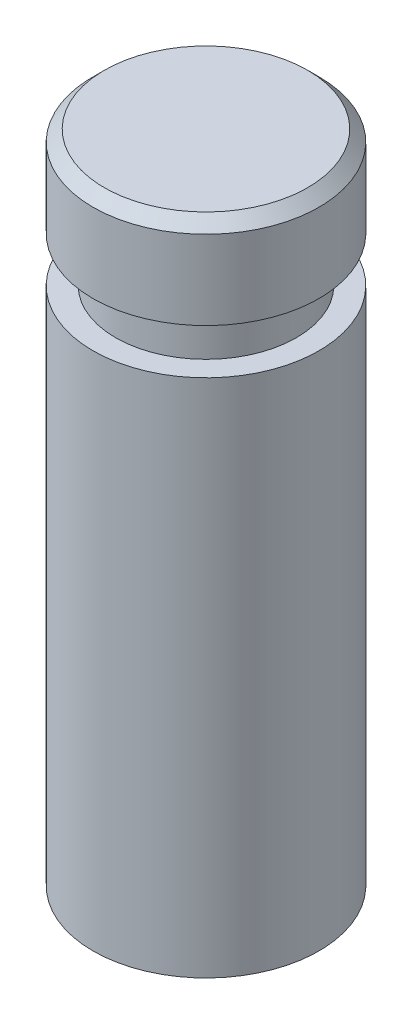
from build123d import *

# Parameters (mm, degrees)
CHANFREIN1_SIZE = 1


with BuildPart() as part:
    # Esquisse1 → R_volution1 (revolve)
    with BuildSketch(Plane.XY, mode=Mode.PRIVATE) as r_volution1_sk:
        Polygon((0, 0), (0, 58), (10, 58), (10, 50), (8, 50), (8, 46), (10, 46), (10, 0), align=None)
    revolve(r_volution1_sk.sketch.rotate(Axis((0, 63.28317648, 0), (0, -1, 0)), 90), axis=Axis((0, 63.28317648, 0), (0, -1, 0)))

    # Chanfrein1
    chanfrein1_edges = [part.edges().sort_by_distance(p)[0] for p in [
        (0, 58, -10),
    ]]
    chamfer(chanfrein1_edges, length=CHANFREIN1_SIZE)


solid = part.part
